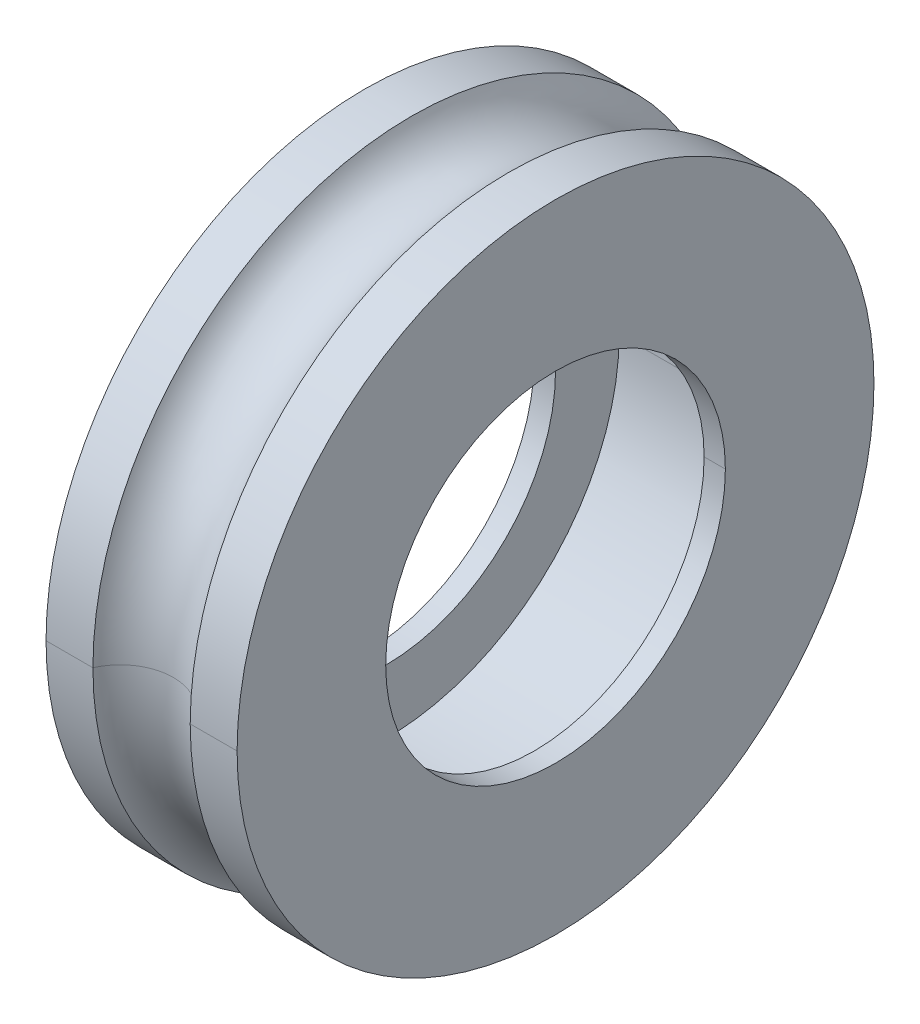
ISO-10303-21;
HEADER;
FILE_DESCRIPTION(('STEP AP214'),'2;1');
FILE_NAME('part.step','',(''),(''),'','','');
FILE_SCHEMA(('AUTOMOTIVE_DESIGN { 1 0 10303 214 1 1 1 1 }'));
ENDSEC;
DATA;
#1=APPLICATION_CONTEXT('core data for automotive mechanical design processes');
#2=APPLICATION_PROTOCOL_DEFINITION('international standard','automotive_design',2000,#1);
#3=PRODUCT_CONTEXT('',#1,'mechanical');
#4=PRODUCT('Part','Part','',(#3));
#5=PRODUCT_RELATED_PRODUCT_CATEGORY('part','',(#4));
#6=PRODUCT_DEFINITION_FORMATION('','',#4);
#7=PRODUCT_DEFINITION_CONTEXT('part definition',#1,'design');
#8=PRODUCT_DEFINITION('design','',#6,#7);
#9=PRODUCT_DEFINITION_SHAPE('','',#8);
#10=(LENGTH_UNIT() NAMED_UNIT(*) SI_UNIT(.MILLI.,.METRE.));
#11=(NAMED_UNIT(*) PLANE_ANGLE_UNIT() SI_UNIT($,.RADIAN.));
#12=(NAMED_UNIT(*) SI_UNIT($,.STERADIAN.) SOLID_ANGLE_UNIT());
#13=UNCERTAINTY_MEASURE_WITH_UNIT(LENGTH_MEASURE(1.E-05),#10,'distance_accuracy_value','');
#14=(GEOMETRIC_REPRESENTATION_CONTEXT(3) GLOBAL_UNCERTAINTY_ASSIGNED_CONTEXT((#13)) GLOBAL_UNIT_ASSIGNED_CONTEXT((#10,
#11,#12)) REPRESENTATION_CONTEXT('',''));
#15=CARTESIAN_POINT('',(0.,0.,0.));
#16=DIRECTION('',(0.,0.,1.));
#17=DIRECTION('',(1.,0.,0.));
#18=AXIS2_PLACEMENT_3D('',#15,#16,#17);
#19=CARTESIAN_POINT('',(-4.5,15.,0.));
#20=DIRECTION('',(-1.,0.,0.));
#21=DIRECTION('',(0.,0.,1.));
#22=AXIS2_PLACEMENT_3D('',#19,#20,#21);
#23=PLANE('',#22);
#24=CARTESIAN_POINT('',(-4.5,0.,0.));
#25=DIRECTION('',(1.,0.,0.));
#26=DIRECTION('',(0.,0.,-1.));
#27=AXIS2_PLACEMENT_3D('',#24,#25,#26);
#28=CIRCLE('',#27,8.);
#29=CARTESIAN_POINT('',(-4.5,0.,-8.));
#30=VERTEX_POINT('',#29);
#31=CARTESIAN_POINT('',(-4.5,0.,8.));
#32=VERTEX_POINT('',#31);
#33=EDGE_CURVE('E11',#30,#32,#28,.T.);
#34=ORIENTED_EDGE('',*,*,#33,.T.);
#35=CARTESIAN_POINT('',(-4.5,0.,0.));
#36=DIRECTION('',(1.,0.,0.));
#37=DIRECTION('',(0.,0.,-1.));
#38=AXIS2_PLACEMENT_3D('',#35,#36,#37);
#39=CIRCLE('',#38,8.);
#40=EDGE_CURVE('E24',#32,#30,#39,.T.);
#41=ORIENTED_EDGE('',*,*,#40,.T.);
#42=EDGE_LOOP('',(#34,#41));
#43=FACE_BOUND('',#42,.T.);
#44=CARTESIAN_POINT('',(-4.5,0.,0.));
#45=DIRECTION('',(1.,0.,0.));
#46=DIRECTION('',(0.,0.,-1.));
#47=AXIS2_PLACEMENT_3D('',#44,#45,#46);
#48=CIRCLE('',#47,15.);
#49=CARTESIAN_POINT('',(-4.5,0.,-15.));
#50=VERTEX_POINT('',#49);
#51=CARTESIAN_POINT('',(-4.5,0.,15.));
#52=VERTEX_POINT('',#51);
#53=EDGE_CURVE('E275',#50,#52,#48,.T.);
#54=ORIENTED_EDGE('',*,*,#53,.F.);
#55=CARTESIAN_POINT('',(-4.5,0.,0.));
#56=DIRECTION('',(1.,0.,0.));
#57=DIRECTION('',(0.,0.,-1.));
#58=AXIS2_PLACEMENT_3D('',#55,#56,#57);
#59=CIRCLE('',#58,15.);
#60=EDGE_CURVE('E270',#52,#50,#59,.T.);
#61=ORIENTED_EDGE('',*,*,#60,.F.);
#62=EDGE_LOOP('',(#54,#61));
#63=FACE_BOUND('',#62,.T.);
#64=ADVANCED_FACE('F16',(#43,#63),#23,.T.);
#65=CARTESIAN_POINT('',(4.5,0.,0.));
#66=DIRECTION('',(-1.,0.,0.));
#67=DIRECTION('',(0.,1.,0.));
#68=AXIS2_PLACEMENT_3D('',#65,#66,#67);
#69=CYLINDRICAL_SURFACE('',#68,15.);
#70=ORIENTED_EDGE('',*,*,#60,.T.);
#71=DIRECTION('',(-1.,0.,0.));
#72=VECTOR('',#71,1.);
#73=CARTESIAN_POINT('',(-2.2912878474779,0.,-15.));
#74=LINE('',#73,#72);
#75=CARTESIAN_POINT('',(-2.2912878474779,0.,-15.));
#76=VERTEX_POINT('',#75);
#77=EDGE_CURVE('E265',#76,#50,#74,.T.);
#78=ORIENTED_EDGE('',*,*,#77,.F.);
#79=CARTESIAN_POINT('',(-2.2912878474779,0.,0.));
#80=DIRECTION('',(1.,0.,0.));
#81=DIRECTION('',(0.,0.,-1.));
#82=AXIS2_PLACEMENT_3D('',#79,#80,#81);
#83=CIRCLE('',#82,15.);
#84=CARTESIAN_POINT('',(-2.29128784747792,0.,15.));
#85=VERTEX_POINT('',#84);
#86=EDGE_CURVE('E261',#85,#76,#83,.T.);
#87=ORIENTED_EDGE('',*,*,#86,.F.);
#88=DIRECTION('',(-1.,0.,0.));
#89=VECTOR('',#88,1.);
#90=CARTESIAN_POINT('',(-2.2912878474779,0.,15.));
#91=LINE('',#90,#89);
#92=EDGE_CURVE('E256',#85,#52,#91,.T.);
#93=ORIENTED_EDGE('',*,*,#92,.T.);
#94=EDGE_LOOP('',(#70,#78,#87,#93));
#95=FACE_BOUND('',#94,.T.);
#96=ADVANCED_FACE('F290',(#95),#69,.T.);
#97=CARTESIAN_POINT('',(4.5,0.,0.));
#98=DIRECTION('',(-1.,0.,0.));
#99=DIRECTION('',(0.,-1.,0.));
#100=AXIS2_PLACEMENT_3D('',#97,#98,#99);
#101=CYLINDRICAL_SURFACE('',#100,15.);
#102=CARTESIAN_POINT('',(-2.2912878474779,0.,0.));
#103=DIRECTION('',(1.,0.,0.));
#104=DIRECTION('',(0.,0.,-1.));
#105=AXIS2_PLACEMENT_3D('',#102,#103,#104);
#106=CIRCLE('',#105,15.);
#107=EDGE_CURVE('E254',#76,#85,#106,.T.);
#108=ORIENTED_EDGE('',*,*,#107,.F.);
#109=ORIENTED_EDGE('',*,*,#77,.T.);
#110=ORIENTED_EDGE('',*,*,#53,.T.);
#111=ORIENTED_EDGE('',*,*,#92,.F.);
#112=EDGE_LOOP('',(#108,#109,#110,#111));
#113=FACE_BOUND('',#112,.T.);
#114=ADVANCED_FACE('F287',(#113),#101,.T.);
#115=CARTESIAN_POINT('',(0.,0.,0.));
#116=DIRECTION('',(1.,0.,0.));
#117=DIRECTION('',(0.,-1.,0.));
#118=AXIS2_PLACEMENT_3D('',#115,#116,#117);
#119=TOROIDAL_SURFACE('',#118,16.,2.5);
#120=ORIENTED_EDGE('',*,*,#107,.T.);
#121=CARTESIAN_POINT('',(2.29128784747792,0.,15.));
#122=CARTESIAN_POINT('',(2.27921225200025,0.,14.9723306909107));
#123=CARTESIAN_POINT('',(2.26663500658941,0.,14.9448803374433));
#124=CARTESIAN_POINT('',(2.240494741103,0.,14.890453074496));
#125=CARTESIAN_POINT('',(2.22693172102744,0.,14.8634761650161));
#126=CARTESIAN_POINT('',(2.19883743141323,0.,14.8100313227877));
#127=CARTESIAN_POINT('',(2.18430616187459,0.,14.7835633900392));
#128=CARTESIAN_POINT('',(2.15429451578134,0.,14.7311711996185));
#129=CARTESIAN_POINT('',(2.13881413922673,0.,14.7052469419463));
#130=CARTESIAN_POINT('',(2.10692457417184,0.,14.6539761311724));
#131=CARTESIAN_POINT('',(2.09051538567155,0.,14.6286295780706));
#132=CARTESIAN_POINT('',(2.05678973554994,0.,14.578547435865));
#133=CARTESIAN_POINT('',(2.03947327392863,0.,14.5538118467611));
#134=CARTESIAN_POINT('',(2.00395580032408,0.,14.5049840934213));
#135=CARTESIAN_POINT('',(1.98575478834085,0.,14.4808919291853));
#136=CARTESIAN_POINT('',(1.94849209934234,0.,14.433382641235));
#137=CARTESIAN_POINT('',(1.92943042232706,0.,14.4099655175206));
#138=CARTESIAN_POINT('',(1.89047141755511,0.,14.3638370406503));
#139=CARTESIAN_POINT('',(1.87057408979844,0.,14.3411256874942));
#140=CARTESIAN_POINT('',(1.82996989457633,0.,14.2964385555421));
#141=CARTESIAN_POINT('',(1.80926302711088,0.,14.274462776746));
#142=CARTESIAN_POINT('',(1.76706692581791,0.,14.231275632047));
#143=CARTESIAN_POINT('',(1.74557769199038,0.,14.2100642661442));
#144=CARTESIAN_POINT('',(1.70184505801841,0.,14.1684337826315));
#145=CARTESIAN_POINT('',(1.67960165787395,0.,14.1480146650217));
#146=CARTESIAN_POINT('',(1.6343898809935,0.,14.1079954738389));
#147=CARTESIAN_POINT('',(1.61142150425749,0.,14.0883954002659));
#148=CARTESIAN_POINT('',(1.56478991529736,0.,14.0500400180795));
#149=CARTESIAN_POINT('',(1.54112670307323,0.,14.031284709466));
#150=CARTESIAN_POINT('',(1.49313649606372,0.,13.994643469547));
#151=CARTESIAN_POINT('',(1.46880950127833,0.,13.9767575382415));
#152=CARTESIAN_POINT('',(1.41952365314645,0.,13.9418785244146));
#153=CARTESIAN_POINT('',(1.39456479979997,0.,13.9248854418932));
#154=CARTESIAN_POINT('',(1.34404798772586,0.,13.8918144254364));
#155=CARTESIAN_POINT('',(1.31849002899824,0.,13.8757364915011));
#156=CARTESIAN_POINT('',(1.26680854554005,0.,13.844516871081));
#157=CARTESIAN_POINT('',(1.24068502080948,0.,13.8293751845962));
#158=CARTESIAN_POINT('',(1.18790668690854,0.,13.8000479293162));
#159=CARTESIAN_POINT('',(1.16125187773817,0.,13.785862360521));
#160=CARTESIAN_POINT('',(1.10744595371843,0.,13.7584659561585));
#161=CARTESIAN_POINT('',(1.08029483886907,0.,13.7452551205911));
#162=CARTESIAN_POINT('',(1.02553193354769,0.,13.7198255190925));
#163=CARTESIAN_POINT('',(0.997920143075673,0.,13.7076067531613));
#164=CARTESIAN_POINT('',(0.942272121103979,0.,13.6841773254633));
#165=CARTESIAN_POINT('',(0.914235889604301,0.,13.6729666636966));
#166=CARTESIAN_POINT('',(0.857775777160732,0.,13.6515681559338));
#167=CARTESIAN_POINT('',(0.829351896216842,0.,13.6413803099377));
#168=CARTESIAN_POINT('',(0.772153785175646,0.,13.6220408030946));
#169=CARTESIAN_POINT('',(0.74337955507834,0.,13.6128891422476));
#170=CARTESIAN_POINT('',(0.685518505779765,0.,13.5956340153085));
#171=CARTESIAN_POINT('',(0.656431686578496,0.,13.5875305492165));
#172=CARTESIAN_POINT('',(0.597983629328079,0.,13.5723824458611));
#173=CARTESIAN_POINT('',(0.56862239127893,0.,13.5653378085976));
#174=CARTESIAN_POINT('',(0.509664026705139,0.,13.5523166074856));
#175=CARTESIAN_POINT('',(0.480066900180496,0.,13.5463400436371));
#176=CARTESIAN_POINT('',(0.42067559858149,0.,13.5354628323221));
#177=CARTESIAN_POINT('',(0.390881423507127,0.,13.5305621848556));
#178=CARTESIAN_POINT('',(0.331135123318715,0.,13.5218432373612));
#179=CARTESIAN_POINT('',(0.301182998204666,0.,13.5180249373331));
#180=CARTESIAN_POINT('',(0.241160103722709,0.,13.511475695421));
#181=CARTESIAN_POINT('',(0.2110893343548,0.,13.508744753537));
#182=CARTESIAN_POINT('',(0.150868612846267,0.,13.5043738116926));
#183=CARTESIAN_POINT('',(0.120718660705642,0.,13.5027338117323));
#184=CARTESIAN_POINT('',(0.0603791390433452,0.,13.500546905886));
#185=CARTESIAN_POINT('',(0.0301895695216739,0.,13.5));
#186=CARTESIAN_POINT('',(-0.0301895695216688,0.,13.5));
#187=CARTESIAN_POINT('',(-0.0603791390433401,0.,13.500546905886));
#188=CARTESIAN_POINT('',(-0.120718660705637,0.,13.5027338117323));
#189=CARTESIAN_POINT('',(-0.150868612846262,0.,13.5043738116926));
#190=CARTESIAN_POINT('',(-0.211089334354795,0.,13.508744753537));
#191=CARTESIAN_POINT('',(-0.241160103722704,0.,13.511475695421));
#192=CARTESIAN_POINT('',(-0.301182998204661,0.,13.5180249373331));
#193=CARTESIAN_POINT('',(-0.33113512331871,0.,13.5218432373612));
#194=CARTESIAN_POINT('',(-0.390881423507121,0.,13.5305621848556));
#195=CARTESIAN_POINT('',(-0.420675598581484,0.,13.5354628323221));
#196=CARTESIAN_POINT('',(-0.48006690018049,0.,13.5463400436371));
#197=CARTESIAN_POINT('',(-0.509664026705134,0.,13.5523166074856));
#198=CARTESIAN_POINT('',(-0.568622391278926,0.,13.5653378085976));
#199=CARTESIAN_POINT('',(-0.597983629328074,0.,13.5723824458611));
#200=CARTESIAN_POINT('',(-0.656431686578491,0.,13.5875305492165));
#201=CARTESIAN_POINT('',(-0.68551850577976,0.,13.5956340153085));
#202=CARTESIAN_POINT('',(-0.743379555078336,0.,13.6128891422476));
#203=CARTESIAN_POINT('',(-0.772153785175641,0.,13.6220408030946));
#204=CARTESIAN_POINT('',(-0.829351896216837,0.,13.6413803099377));
#205=CARTESIAN_POINT('',(-0.857775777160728,0.,13.6515681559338));
#206=CARTESIAN_POINT('',(-0.914235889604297,0.,13.6729666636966));
#207=CARTESIAN_POINT('',(-0.942272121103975,0.,13.6841773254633));
#208=CARTESIAN_POINT('',(-0.997920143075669,0.,13.7076067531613));
#209=CARTESIAN_POINT('',(-1.02553193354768,0.,13.7198255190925));
#210=CARTESIAN_POINT('',(-1.08029483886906,0.,13.7452551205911));
#211=CARTESIAN_POINT('',(-1.10744595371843,0.,13.7584659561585));
#212=CARTESIAN_POINT('',(-1.16125187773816,0.,13.785862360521));
#213=CARTESIAN_POINT('',(-1.18790668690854,0.,13.8000479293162));
#214=CARTESIAN_POINT('',(-1.24068502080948,0.,13.8293751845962));
#215=CARTESIAN_POINT('',(-1.26680854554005,0.,13.844516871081));
#216=CARTESIAN_POINT('',(-1.31849002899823,0.,13.8757364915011));
#217=CARTESIAN_POINT('',(-1.34404798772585,0.,13.8918144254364));
#218=CARTESIAN_POINT('',(-1.39456479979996,0.,13.9248854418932));
#219=CARTESIAN_POINT('',(-1.41952365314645,0.,13.9418785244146));
#220=CARTESIAN_POINT('',(-1.46880950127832,0.,13.9767575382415));
#221=CARTESIAN_POINT('',(-1.49313649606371,0.,13.994643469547));
#222=CARTESIAN_POINT('',(-1.54112670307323,0.,14.031284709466));
#223=CARTESIAN_POINT('',(-1.56478991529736,0.,14.0500400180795));
#224=CARTESIAN_POINT('',(-1.61142150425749,0.,14.0883954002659));
#225=CARTESIAN_POINT('',(-1.63438988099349,0.,14.1079954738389));
#226=CARTESIAN_POINT('',(-1.67960165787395,0.,14.1480146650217));
#227=CARTESIAN_POINT('',(-1.7018450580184,0.,14.1684337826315));
#228=CARTESIAN_POINT('',(-1.74557769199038,0.,14.2100642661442));
#229=CARTESIAN_POINT('',(-1.76706692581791,0.,14.231275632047));
#230=CARTESIAN_POINT('',(-1.80926302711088,0.,14.274462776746));
#231=CARTESIAN_POINT('',(-1.82996989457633,0.,14.2964385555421));
#232=CARTESIAN_POINT('',(-1.87057408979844,0.,14.3411256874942));
#233=CARTESIAN_POINT('',(-1.8904714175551,0.,14.3638370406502));
#234=CARTESIAN_POINT('',(-1.92943042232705,0.,14.4099655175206));
#235=CARTESIAN_POINT('',(-1.94849209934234,0.,14.433382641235));
#236=CARTESIAN_POINT('',(-1.98575478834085,0.,14.4808919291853));
#237=CARTESIAN_POINT('',(-2.00395580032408,0.,14.5049840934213));
#238=CARTESIAN_POINT('',(-2.03947327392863,0.,14.5538118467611));
#239=CARTESIAN_POINT('',(-2.05678973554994,0.,14.5785474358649));
#240=CARTESIAN_POINT('',(-2.09051538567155,0.,14.6286295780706));
#241=CARTESIAN_POINT('',(-2.10692457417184,0.,14.6539761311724));
#242=CARTESIAN_POINT('',(-2.13881413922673,0.,14.7052469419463));
#243=CARTESIAN_POINT('',(-2.15429451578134,0.,14.7311711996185));
#244=CARTESIAN_POINT('',(-2.18430616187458,0.,14.7835633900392));
#245=CARTESIAN_POINT('',(-2.19883743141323,0.,14.8100313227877));
#246=CARTESIAN_POINT('',(-2.22693172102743,0.,14.8634761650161));
#247=CARTESIAN_POINT('',(-2.240494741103,0.,14.890453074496));
#248=CARTESIAN_POINT('',(-2.2666350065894,0.,14.9448803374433));
#249=CARTESIAN_POINT('',(-2.27921225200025,0.,14.9723306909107));
#250=CARTESIAN_POINT('',(-2.29128784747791,0.,15.));
#251=B_SPLINE_CURVE_WITH_KNOTS('',3,(#121,#122,#123,#124,#125,#126,#127,#128,#129,#130,#131,
#132,#133,#134,#135,#136,#137,#138,#139,#140,#141,#142,#143,#144,#145,#146,#147,#148,#149,#150,
#151,#152,#153,#154,#155,#156,#157,#158,#159,#160,#161,#162,#163,#164,#165,#166,#167,#168,#169,
#170,#171,#172,#173,#174,#175,#176,#177,#178,#179,#180,#181,#182,#183,#184,#185,#186,#187,#188,
#189,#190,#191,#192,#193,#194,#195,#196,#197,#198,#199,#200,#201,#202,#203,#204,#205,#206,#207,
#208,#209,#210,#211,#212,#213,#214,#215,#216,#217,#218,#219,#220,#221,#222,#223,#224,#225,#226,
#227,#228,#229,#230,#231,#232,#233,#234,#235,#236,#237,#238,#239,#240,#241,#242,#243,#244,#245,
#246,#247,#248,#249,#250),.UNSPECIFIED.,.F.,.F.,(4,2,2,2,2,2,2,2,2,2,2,2,2,2,2,2,2,2,2,2,2,2,2,
2,2,2,2,2,2,2,2,2,2,2,2,2,2,2,2,2,2,2,2,2,2,2,2,2,2,2,2,2,2,2,2,2,2,2,2,2,2,2,2,2,4),(0.,
0.0905637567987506,0.1811275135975,0.271691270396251,0.362255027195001,0.45281878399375,
0.543382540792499,0.633946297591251,0.72451005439,0.81507381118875,0.905637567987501,
0.99620132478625,1.086765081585,1.17732883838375,1.2678925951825,1.35845635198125,1.44902010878,
1.53958386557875,1.6301476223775,1.72071137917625,1.811275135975,1.90183889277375,
1.9924026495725,2.08296640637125,2.17353016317,2.26409391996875,2.3546576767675,
2.44522143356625,2.535785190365,2.62634894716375,2.7169127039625,2.80747646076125,2.89804021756,
2.98860397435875,3.0791677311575,3.16973148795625,3.260295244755,3.35085900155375,
3.4414227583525,3.53198651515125,3.62255027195,3.71311402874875,3.8036777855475,
3.89424154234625,3.984805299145,4.07536905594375,4.1659328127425,4.25649656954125,4.34706032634,
4.43762408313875,4.5281878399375,4.61875159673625,4.709315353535,4.79987911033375,
4.8904428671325,4.98100662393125,5.07157038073,5.16213413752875,5.2526978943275,
5.34326165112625,5.433825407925,5.52438916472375,5.6149529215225,5.70551667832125,
5.79608043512),.UNSPECIFIED.);
#252=CARTESIAN_POINT('',(2.2912878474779,0.,15.));
#253=VERTEX_POINT('',#252);
#254=EDGE_CURVE('E222',#253,#85,#251,.T.);
#255=ORIENTED_EDGE('',*,*,#254,.F.);
#256=CARTESIAN_POINT('',(2.2912878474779,0.,0.));
#257=DIRECTION('',(1.,0.,0.));
#258=DIRECTION('',(0.,0.,-1.));
#259=AXIS2_PLACEMENT_3D('',#256,#257,#258);
#260=CIRCLE('',#259,15.);
#261=CARTESIAN_POINT('',(2.2912878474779,0.,-15.));
#262=VERTEX_POINT('',#261);
#263=EDGE_CURVE('E240',#262,#253,#260,.T.);
#264=ORIENTED_EDGE('',*,*,#263,.F.);
#265=CARTESIAN_POINT('',(2.29128784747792,0.,-15.));
#266=CARTESIAN_POINT('',(2.27921225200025,0.,-14.9723306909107));
#267=CARTESIAN_POINT('',(2.26663500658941,0.,-14.9448803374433));
#268=CARTESIAN_POINT('',(2.240494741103,0.,-14.890453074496));
#269=CARTESIAN_POINT('',(2.22693172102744,0.,-14.8634761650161));
#270=CARTESIAN_POINT('',(2.19883743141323,0.,-14.8100313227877));
#271=CARTESIAN_POINT('',(2.18430616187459,0.,-14.7835633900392));
#272=CARTESIAN_POINT('',(2.15429451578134,0.,-14.7311711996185));
#273=CARTESIAN_POINT('',(2.13881413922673,0.,-14.7052469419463));
#274=CARTESIAN_POINT('',(2.10692457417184,0.,-14.6539761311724));
#275=CARTESIAN_POINT('',(2.09051538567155,0.,-14.6286295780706));
#276=CARTESIAN_POINT('',(2.05678973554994,0.,-14.578547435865));
#277=CARTESIAN_POINT('',(2.03947327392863,0.,-14.5538118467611));
#278=CARTESIAN_POINT('',(2.00395580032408,0.,-14.5049840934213));
#279=CARTESIAN_POINT('',(1.98575478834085,0.,-14.4808919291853));
#280=CARTESIAN_POINT('',(1.94849209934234,0.,-14.433382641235));
#281=CARTESIAN_POINT('',(1.92943042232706,0.,-14.4099655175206));
#282=CARTESIAN_POINT('',(1.89047141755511,0.,-14.3638370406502));
#283=CARTESIAN_POINT('',(1.87057408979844,0.,-14.3411256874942));
#284=CARTESIAN_POINT('',(1.82996989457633,0.,-14.2964385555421));
#285=CARTESIAN_POINT('',(1.80926302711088,0.,-14.274462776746));
#286=CARTESIAN_POINT('',(1.76706692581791,0.,-14.231275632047));
#287=CARTESIAN_POINT('',(1.74557769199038,0.,-14.2100642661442));
#288=CARTESIAN_POINT('',(1.7018450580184,0.,-14.1684337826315));
#289=CARTESIAN_POINT('',(1.67960165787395,0.,-14.1480146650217));
#290=CARTESIAN_POINT('',(1.63438988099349,0.,-14.1079954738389));
#291=CARTESIAN_POINT('',(1.61142150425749,0.,-14.0883954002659));
#292=CARTESIAN_POINT('',(1.56478991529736,0.,-14.0500400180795));
#293=CARTESIAN_POINT('',(1.54112670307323,0.,-14.031284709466));
#294=CARTESIAN_POINT('',(1.49313649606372,0.,-13.994643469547));
#295=CARTESIAN_POINT('',(1.46880950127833,0.,-13.9767575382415));
#296=CARTESIAN_POINT('',(1.41952365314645,0.,-13.9418785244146));
#297=CARTESIAN_POINT('',(1.39456479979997,0.,-13.9248854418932));
#298=CARTESIAN_POINT('',(1.34404798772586,0.,-13.8918144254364));
#299=CARTESIAN_POINT('',(1.31849002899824,0.,-13.8757364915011));
#300=CARTESIAN_POINT('',(1.26680854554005,0.,-13.844516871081));
#301=CARTESIAN_POINT('',(1.24068502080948,0.,-13.8293751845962));
#302=CARTESIAN_POINT('',(1.18790668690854,0.,-13.8000479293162));
#303=CARTESIAN_POINT('',(1.16125187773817,0.,-13.785862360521));
#304=CARTESIAN_POINT('',(1.10744595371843,0.,-13.7584659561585));
#305=CARTESIAN_POINT('',(1.08029483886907,0.,-13.7452551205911));
#306=CARTESIAN_POINT('',(1.02553193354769,0.,-13.7198255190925));
#307=CARTESIAN_POINT('',(0.997920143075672,0.,-13.7076067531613));
#308=CARTESIAN_POINT('',(0.942272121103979,0.,-13.6841773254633));
#309=CARTESIAN_POINT('',(0.9142358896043,0.,-13.6729666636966));
#310=CARTESIAN_POINT('',(0.857775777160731,0.,-13.6515681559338));
#311=CARTESIAN_POINT('',(0.829351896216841,0.,-13.6413803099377));
#312=CARTESIAN_POINT('',(0.772153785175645,0.,-13.6220408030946));
#313=CARTESIAN_POINT('',(0.743379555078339,0.,-13.6128891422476));
#314=CARTESIAN_POINT('',(0.685518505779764,0.,-13.5956340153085));
#315=CARTESIAN_POINT('',(0.656431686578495,0.,-13.5875305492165));
#316=CARTESIAN_POINT('',(0.597983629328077,0.,-13.5723824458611));
#317=CARTESIAN_POINT('',(0.568622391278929,0.,-13.5653378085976));
#318=CARTESIAN_POINT('',(0.509664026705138,0.,-13.5523166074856));
#319=CARTESIAN_POINT('',(0.480066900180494,0.,-13.5463400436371));
#320=CARTESIAN_POINT('',(0.420675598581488,0.,-13.5354628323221));
#321=CARTESIAN_POINT('',(0.390881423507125,0.,-13.5305621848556));
#322=CARTESIAN_POINT('',(0.331135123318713,0.,-13.5218432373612));
#323=CARTESIAN_POINT('',(0.301182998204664,0.,-13.5180249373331));
#324=CARTESIAN_POINT('',(0.241160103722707,0.,-13.511475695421));
#325=CARTESIAN_POINT('',(0.211089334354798,0.,-13.508744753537));
#326=CARTESIAN_POINT('',(0.150868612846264,0.,-13.5043738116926));
#327=CARTESIAN_POINT('',(0.120718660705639,0.,-13.5027338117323));
#328=CARTESIAN_POINT('',(0.0603791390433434,0.,-13.500546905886));
#329=CARTESIAN_POINT('',(0.0301895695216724,0.,-13.5));
#330=CARTESIAN_POINT('',(-0.0301895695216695,0.,-13.5));
#331=CARTESIAN_POINT('',(-0.0603791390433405,0.,-13.500546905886));
#332=CARTESIAN_POINT('',(-0.120718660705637,0.,-13.5027338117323));
#333=CARTESIAN_POINT('',(-0.150868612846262,0.,-13.5043738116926));
#334=CARTESIAN_POINT('',(-0.211089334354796,0.,-13.508744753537));
#335=CARTESIAN_POINT('',(-0.241160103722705,0.,-13.511475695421));
#336=CARTESIAN_POINT('',(-0.301182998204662,0.,-13.5180249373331));
#337=CARTESIAN_POINT('',(-0.33113512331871,0.,-13.5218432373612));
#338=CARTESIAN_POINT('',(-0.390881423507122,0.,-13.5305621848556));
#339=CARTESIAN_POINT('',(-0.420675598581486,0.,-13.5354628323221));
#340=CARTESIAN_POINT('',(-0.480066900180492,0.,-13.5463400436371));
#341=CARTESIAN_POINT('',(-0.509664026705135,0.,-13.5523166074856));
#342=CARTESIAN_POINT('',(-0.568622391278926,0.,-13.5653378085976));
#343=CARTESIAN_POINT('',(-0.597983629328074,0.,-13.5723824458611));
#344=CARTESIAN_POINT('',(-0.656431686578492,0.,-13.5875305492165));
#345=CARTESIAN_POINT('',(-0.685518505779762,0.,-13.5956340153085));
#346=CARTESIAN_POINT('',(-0.743379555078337,0.,-13.6128891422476));
#347=CARTESIAN_POINT('',(-0.772153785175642,0.,-13.6220408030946));
#348=CARTESIAN_POINT('',(-0.829351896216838,0.,-13.6413803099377));
#349=CARTESIAN_POINT('',(-0.857775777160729,0.,-13.6515681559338));
#350=CARTESIAN_POINT('',(-0.914235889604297,0.,-13.6729666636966));
#351=CARTESIAN_POINT('',(-0.942272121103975,0.,-13.6841773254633));
#352=CARTESIAN_POINT('',(-0.997920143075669,0.,-13.7076067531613));
#353=CARTESIAN_POINT('',(-1.02553193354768,0.,-13.7198255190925));
#354=CARTESIAN_POINT('',(-1.08029483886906,0.,-13.7452551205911));
#355=CARTESIAN_POINT('',(-1.10744595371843,0.,-13.7584659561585));
#356=CARTESIAN_POINT('',(-1.16125187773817,0.,-13.785862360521));
#357=CARTESIAN_POINT('',(-1.18790668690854,0.,-13.8000479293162));
#358=CARTESIAN_POINT('',(-1.24068502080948,0.,-13.8293751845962));
#359=CARTESIAN_POINT('',(-1.26680854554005,0.,-13.844516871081));
#360=CARTESIAN_POINT('',(-1.31849002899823,0.,-13.8757364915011));
#361=CARTESIAN_POINT('',(-1.34404798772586,0.,-13.8918144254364));
#362=CARTESIAN_POINT('',(-1.39456479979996,0.,-13.9248854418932));
#363=CARTESIAN_POINT('',(-1.41952365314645,0.,-13.9418785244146));
#364=CARTESIAN_POINT('',(-1.46880950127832,0.,-13.9767575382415));
#365=CARTESIAN_POINT('',(-1.49313649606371,0.,-13.994643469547));
#366=CARTESIAN_POINT('',(-1.54112670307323,0.,-14.031284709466));
#367=CARTESIAN_POINT('',(-1.56478991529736,0.,-14.0500400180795));
#368=CARTESIAN_POINT('',(-1.61142150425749,0.,-14.0883954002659));
#369=CARTESIAN_POINT('',(-1.63438988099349,0.,-14.1079954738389));
#370=CARTESIAN_POINT('',(-1.67960165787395,0.,-14.1480146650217));
#371=CARTESIAN_POINT('',(-1.7018450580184,0.,-14.1684337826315));
#372=CARTESIAN_POINT('',(-1.74557769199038,0.,-14.2100642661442));
#373=CARTESIAN_POINT('',(-1.76706692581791,0.,-14.231275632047));
#374=CARTESIAN_POINT('',(-1.80926302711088,0.,-14.274462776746));
#375=CARTESIAN_POINT('',(-1.82996989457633,0.,-14.2964385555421));
#376=CARTESIAN_POINT('',(-1.87057408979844,0.,-14.3411256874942));
#377=CARTESIAN_POINT('',(-1.89047141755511,0.,-14.3638370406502));
#378=CARTESIAN_POINT('',(-1.92943042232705,0.,-14.4099655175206));
#379=CARTESIAN_POINT('',(-1.94849209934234,0.,-14.433382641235));
#380=CARTESIAN_POINT('',(-1.98575478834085,0.,-14.4808919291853));
#381=CARTESIAN_POINT('',(-2.00395580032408,0.,-14.5049840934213));
#382=CARTESIAN_POINT('',(-2.03947327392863,0.,-14.5538118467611));
#383=CARTESIAN_POINT('',(-2.05678973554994,0.,-14.578547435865));
#384=CARTESIAN_POINT('',(-2.09051538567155,0.,-14.6286295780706));
#385=CARTESIAN_POINT('',(-2.10692457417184,0.,-14.6539761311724));
#386=CARTESIAN_POINT('',(-2.13881413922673,0.,-14.7052469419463));
#387=CARTESIAN_POINT('',(-2.15429451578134,0.,-14.7311711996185));
#388=CARTESIAN_POINT('',(-2.18430616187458,0.,-14.7835633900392));
#389=CARTESIAN_POINT('',(-2.19883743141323,0.,-14.8100313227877));
#390=CARTESIAN_POINT('',(-2.22693172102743,0.,-14.8634761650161));
#391=CARTESIAN_POINT('',(-2.240494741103,0.,-14.890453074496));
#392=CARTESIAN_POINT('',(-2.2666350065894,0.,-14.9448803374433));
#393=CARTESIAN_POINT('',(-2.27921225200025,0.,-14.9723306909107));
#394=CARTESIAN_POINT('',(-2.29128784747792,0.,-15.));
#395=B_SPLINE_CURVE_WITH_KNOTS('',3,(#265,#266,#267,#268,#269,#270,#271,#272,#273,#274,#275,
#276,#277,#278,#279,#280,#281,#282,#283,#284,#285,#286,#287,#288,#289,#290,#291,#292,#293,#294,
#295,#296,#297,#298,#299,#300,#301,#302,#303,#304,#305,#306,#307,#308,#309,#310,#311,#312,#313,
#314,#315,#316,#317,#318,#319,#320,#321,#322,#323,#324,#325,#326,#327,#328,#329,#330,#331,#332,
#333,#334,#335,#336,#337,#338,#339,#340,#341,#342,#343,#344,#345,#346,#347,#348,#349,#350,#351,
#352,#353,#354,#355,#356,#357,#358,#359,#360,#361,#362,#363,#364,#365,#366,#367,#368,#369,#370,
#371,#372,#373,#374,#375,#376,#377,#378,#379,#380,#381,#382,#383,#384,#385,#386,#387,#388,#389,
#390,#391,#392,#393,#394),.UNSPECIFIED.,.F.,.F.,(4,2,2,2,2,2,2,2,2,2,2,2,2,2,2,2,2,2,2,2,2,2,2,
2,2,2,2,2,2,2,2,2,2,2,2,2,2,2,2,2,2,2,2,2,2,2,2,2,2,2,2,2,2,2,2,2,2,2,2,2,2,2,2,2,4),(0.,
0.0905637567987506,0.1811275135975,0.271691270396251,0.362255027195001,0.45281878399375,
0.543382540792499,0.633946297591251,0.724510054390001,0.81507381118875,0.905637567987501,
0.996201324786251,1.086765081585,1.17732883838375,1.2678925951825,1.35845635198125,
1.44902010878,1.53958386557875,1.6301476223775,1.72071137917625,1.811275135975,1.90183889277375,
1.9924026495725,2.08296640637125,2.17353016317,2.26409391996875,2.3546576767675,
2.44522143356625,2.535785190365,2.62634894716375,2.7169127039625,2.80747646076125,2.89804021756,
2.98860397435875,3.0791677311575,3.16973148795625,3.260295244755,3.35085900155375,
3.4414227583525,3.53198651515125,3.62255027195,3.71311402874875,3.8036777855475,
3.89424154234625,3.984805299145,4.07536905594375,4.1659328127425,4.25649656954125,4.34706032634,
4.43762408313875,4.5281878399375,4.61875159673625,4.709315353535,4.79987911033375,
4.8904428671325,4.98100662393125,5.07157038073,5.16213413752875,5.2526978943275,
5.34326165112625,5.43382540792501,5.52438916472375,5.6149529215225,5.70551667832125,
5.79608043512),.UNSPECIFIED.);
#396=EDGE_CURVE('E225',#262,#76,#395,.T.);
#397=ORIENTED_EDGE('',*,*,#396,.T.);
#398=EDGE_LOOP('',(#120,#255,#264,#397));
#399=FACE_BOUND('',#398,.T.);
#400=ADVANCED_FACE('F204',(#399),#119,.F.);
#401=CARTESIAN_POINT('',(0.,0.,0.));
#402=DIRECTION('',(1.,0.,0.));
#403=DIRECTION('',(0.,1.,0.));
#404=AXIS2_PLACEMENT_3D('',#401,#402,#403);
#405=TOROIDAL_SURFACE('',#404,16.,2.5);
#406=CARTESIAN_POINT('',(2.2912878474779,0.,0.));
#407=DIRECTION('',(1.,0.,0.));
#408=DIRECTION('',(0.,0.,-1.));
#409=AXIS2_PLACEMENT_3D('',#406,#407,#408);
#410=CIRCLE('',#409,15.);
#411=EDGE_CURVE('E184',#253,#262,#410,.T.);
#412=ORIENTED_EDGE('',*,*,#411,.F.);
#413=ORIENTED_EDGE('',*,*,#254,.T.);
#414=ORIENTED_EDGE('',*,*,#86,.T.);
#415=ORIENTED_EDGE('',*,*,#396,.F.);
#416=EDGE_LOOP('',(#412,#413,#414,#415));
#417=FACE_BOUND('',#416,.T.);
#418=ADVANCED_FACE('F193',(#417),#405,.F.);
#419=CARTESIAN_POINT('',(4.5,0.,0.));
#420=DIRECTION('',(-1.,0.,0.));
#421=DIRECTION('',(0.,1.,0.));
#422=AXIS2_PLACEMENT_3D('',#419,#420,#421);
#423=CYLINDRICAL_SURFACE('',#422,15.);
#424=ORIENTED_EDGE('',*,*,#411,.T.);
#425=DIRECTION('',(-1.,0.,0.));
#426=VECTOR('',#425,1.);
#427=CARTESIAN_POINT('',(4.5,0.,-15.));
#428=LINE('',#427,#426);
#429=CARTESIAN_POINT('',(4.5,0.,-15.));
#430=VERTEX_POINT('',#429);
#431=EDGE_CURVE('E179',#430,#262,#428,.T.);
#432=ORIENTED_EDGE('',*,*,#431,.F.);
#433=CARTESIAN_POINT('',(4.5,0.,0.));
#434=DIRECTION('',(1.,0.,0.));
#435=DIRECTION('',(0.,0.,-1.));
#436=AXIS2_PLACEMENT_3D('',#433,#434,#435);
#437=CIRCLE('',#436,15.);
#438=CARTESIAN_POINT('',(4.5,0.,15.));
#439=VERTEX_POINT('',#438);
#440=EDGE_CURVE('E174',#439,#430,#437,.T.);
#441=ORIENTED_EDGE('',*,*,#440,.F.);
#442=DIRECTION('',(-1.,0.,0.));
#443=VECTOR('',#442,1.);
#444=CARTESIAN_POINT('',(4.5,0.,15.));
#445=LINE('',#444,#443);
#446=EDGE_CURVE('E169',#439,#253,#445,.T.);
#447=ORIENTED_EDGE('',*,*,#446,.T.);
#448=EDGE_LOOP('',(#424,#432,#441,#447));
#449=FACE_BOUND('',#448,.T.);
#450=ADVANCED_FACE('F203',(#449),#423,.T.);
#451=CARTESIAN_POINT('',(4.5,0.,0.));
#452=DIRECTION('',(-1.,0.,0.));
#453=DIRECTION('',(0.,-1.,0.));
#454=AXIS2_PLACEMENT_3D('',#451,#452,#453);
#455=CYLINDRICAL_SURFACE('',#454,15.);
#456=CARTESIAN_POINT('',(4.5,0.,0.));
#457=DIRECTION('',(1.,0.,0.));
#458=DIRECTION('',(0.,0.,-1.));
#459=AXIS2_PLACEMENT_3D('',#456,#457,#458);
#460=CIRCLE('',#459,15.);
#461=EDGE_CURVE('E164',#430,#439,#460,.T.);
#462=ORIENTED_EDGE('',*,*,#461,.F.);
#463=ORIENTED_EDGE('',*,*,#431,.T.);
#464=ORIENTED_EDGE('',*,*,#263,.T.);
#465=ORIENTED_EDGE('',*,*,#446,.F.);
#466=EDGE_LOOP('',(#462,#463,#464,#465));
#467=FACE_BOUND('',#466,.T.);
#468=ADVANCED_FACE('F295',(#467),#455,.T.);
#469=CARTESIAN_POINT('',(4.5,8.,0.));
#470=DIRECTION('',(1.,0.,0.));
#471=DIRECTION('',(0.,0.,-1.));
#472=AXIS2_PLACEMENT_3D('',#469,#470,#471);
#473=PLANE('',#472);
#474=ORIENTED_EDGE('',*,*,#461,.T.);
#475=ORIENTED_EDGE('',*,*,#440,.T.);
#476=EDGE_LOOP('',(#474,#475));
#477=FACE_BOUND('',#476,.T.);
#478=CARTESIAN_POINT('',(4.5,0.,0.));
#479=DIRECTION('',(1.,0.,0.));
#480=DIRECTION('',(0.,0.,-1.));
#481=AXIS2_PLACEMENT_3D('',#478,#479,#480);
#482=CIRCLE('',#481,8.);
#483=CARTESIAN_POINT('',(4.5,0.,-8.));
#484=VERTEX_POINT('',#483);
#485=CARTESIAN_POINT('',(4.5,0.,8.));
#486=VERTEX_POINT('',#485);
#487=EDGE_CURVE('E159',#484,#486,#482,.T.);
#488=ORIENTED_EDGE('',*,*,#487,.F.);
#489=CARTESIAN_POINT('',(4.5,0.,0.));
#490=DIRECTION('',(1.,0.,0.));
#491=DIRECTION('',(0.,0.,-1.));
#492=AXIS2_PLACEMENT_3D('',#489,#490,#491);
#493=CIRCLE('',#492,8.);
#494=EDGE_CURVE('E154',#486,#484,#493,.T.);
#495=ORIENTED_EDGE('',*,*,#494,.F.);
#496=EDGE_LOOP('',(#488,#495));
#497=FACE_BOUND('',#496,.T.);
#498=ADVANCED_FACE('F297',(#477,#497),#473,.T.);
#499=CARTESIAN_POINT('',(4.5,0.,0.));
#500=DIRECTION('',(-1.,0.,0.));
#501=DIRECTION('',(0.,1.,0.));
#502=AXIS2_PLACEMENT_3D('',#499,#500,#501);
#503=CYLINDRICAL_SURFACE('',#502,8.);
#504=CARTESIAN_POINT('',(3.5,0.,0.));
#505=DIRECTION('',(1.,0.,0.));
#506=DIRECTION('',(0.,0.,-1.));
#507=AXIS2_PLACEMENT_3D('',#504,#505,#506);
#508=CIRCLE('',#507,8.);
#509=CARTESIAN_POINT('',(3.5,0.,8.));
#510=VERTEX_POINT('',#509);
#511=CARTESIAN_POINT('',(3.5,0.,-8.));
#512=VERTEX_POINT('',#511);
#513=EDGE_CURVE('E149',#510,#512,#508,.T.);
#514=ORIENTED_EDGE('',*,*,#513,.F.);
#515=DIRECTION('',(-1.,0.,0.));
#516=VECTOR('',#515,1.);
#517=CARTESIAN_POINT('',(4.5,0.,8.));
#518=LINE('',#517,#516);
#519=EDGE_CURVE('E144',#486,#510,#518,.T.);
#520=ORIENTED_EDGE('',*,*,#519,.F.);
#521=ORIENTED_EDGE('',*,*,#494,.T.);
#522=DIRECTION('',(-1.,0.,0.));
#523=VECTOR('',#522,1.);
#524=CARTESIAN_POINT('',(4.5,0.,-8.));
#525=LINE('',#524,#523);
#526=EDGE_CURVE('E140',#484,#512,#525,.T.);
#527=ORIENTED_EDGE('',*,*,#526,.T.);
#528=EDGE_LOOP('',(#514,#520,#521,#527));
#529=FACE_BOUND('',#528,.T.);
#530=ADVANCED_FACE('F300',(#529),#503,.F.);
#531=CARTESIAN_POINT('',(4.5,0.,0.));
#532=DIRECTION('',(-1.,0.,0.));
#533=DIRECTION('',(0.,-1.,0.));
#534=AXIS2_PLACEMENT_3D('',#531,#532,#533);
#535=CYLINDRICAL_SURFACE('',#534,8.);
#536=ORIENTED_EDGE('',*,*,#487,.T.);
#537=ORIENTED_EDGE('',*,*,#519,.T.);
#538=CARTESIAN_POINT('',(3.5,0.,0.));
#539=DIRECTION('',(1.,0.,0.));
#540=DIRECTION('',(0.,0.,-1.));
#541=AXIS2_PLACEMENT_3D('',#538,#539,#540);
#542=CIRCLE('',#541,8.);
#543=EDGE_CURVE('E135',#512,#510,#542,.T.);
#544=ORIENTED_EDGE('',*,*,#543,.F.);
#545=ORIENTED_EDGE('',*,*,#526,.F.);
#546=EDGE_LOOP('',(#536,#537,#544,#545));
#547=FACE_BOUND('',#546,.T.);
#548=ADVANCED_FACE('F307',(#547),#535,.F.);
#549=CARTESIAN_POINT('',(3.5,11.,0.));
#550=DIRECTION('',(-1.,0.,0.));
#551=DIRECTION('',(0.,0.,1.));
#552=AXIS2_PLACEMENT_3D('',#549,#550,#551);
#553=PLANE('',#552);
#554=ORIENTED_EDGE('',*,*,#543,.T.);
#555=ORIENTED_EDGE('',*,*,#513,.T.);
#556=EDGE_LOOP('',(#554,#555));
#557=FACE_BOUND('',#556,.T.);
#558=CARTESIAN_POINT('',(3.5,0.,0.));
#559=DIRECTION('',(1.,0.,0.));
#560=DIRECTION('',(0.,0.,-1.));
#561=AXIS2_PLACEMENT_3D('',#558,#559,#560);
#562=CIRCLE('',#561,11.);
#563=CARTESIAN_POINT('',(3.5,0.,-11.));
#564=VERTEX_POINT('',#563);
#565=CARTESIAN_POINT('',(3.5,0.,11.));
#566=VERTEX_POINT('',#565);
#567=EDGE_CURVE('E130',#564,#566,#562,.T.);
#568=ORIENTED_EDGE('',*,*,#567,.F.);
#569=CARTESIAN_POINT('',(3.5,0.,0.));
#570=DIRECTION('',(1.,0.,0.));
#571=DIRECTION('',(0.,0.,-1.));
#572=AXIS2_PLACEMENT_3D('',#569,#570,#571);
#573=CIRCLE('',#572,11.);
#574=EDGE_CURVE('E125',#566,#564,#573,.T.);
#575=ORIENTED_EDGE('',*,*,#574,.F.);
#576=EDGE_LOOP('',(#568,#575));
#577=FACE_BOUND('',#576,.T.);
#578=ADVANCED_FACE('F309',(#557,#577),#553,.T.);
#579=CARTESIAN_POINT('',(4.5,0.,0.));
#580=DIRECTION('',(-1.,0.,0.));
#581=DIRECTION('',(0.,1.,0.));
#582=AXIS2_PLACEMENT_3D('',#579,#580,#581);
#583=CYLINDRICAL_SURFACE('',#582,11.);
#584=CARTESIAN_POINT('',(-3.5,0.,0.));
#585=DIRECTION('',(1.,0.,0.));
#586=DIRECTION('',(0.,0.,-1.));
#587=AXIS2_PLACEMENT_3D('',#584,#585,#586);
#588=CIRCLE('',#587,11.);
#589=CARTESIAN_POINT('',(-3.5,0.,11.));
#590=VERTEX_POINT('',#589);
#591=CARTESIAN_POINT('',(-3.5,0.,-11.));
#592=VERTEX_POINT('',#591);
#593=EDGE_CURVE('E120',#590,#592,#588,.T.);
#594=ORIENTED_EDGE('',*,*,#593,.F.);
#595=DIRECTION('',(-1.,0.,0.));
#596=VECTOR('',#595,1.);
#597=CARTESIAN_POINT('',(3.5,0.,11.));
#598=LINE('',#597,#596);
#599=EDGE_CURVE('E115',#566,#590,#598,.T.);
#600=ORIENTED_EDGE('',*,*,#599,.F.);
#601=ORIENTED_EDGE('',*,*,#574,.T.);
#602=DIRECTION('',(-1.,0.,0.));
#603=VECTOR('',#602,1.);
#604=CARTESIAN_POINT('',(3.5,0.,-11.));
#605=LINE('',#604,#603);
#606=EDGE_CURVE('E105',#564,#592,#605,.T.);
#607=ORIENTED_EDGE('',*,*,#606,.T.);
#608=EDGE_LOOP('',(#594,#600,#601,#607));
#609=FACE_BOUND('',#608,.T.);
#610=ADVANCED_FACE('F312',(#609),#583,.F.);
#611=CARTESIAN_POINT('',(4.5,0.,0.));
#612=DIRECTION('',(-1.,0.,0.));
#613=DIRECTION('',(0.,-1.,0.));
#614=AXIS2_PLACEMENT_3D('',#611,#612,#613);
#615=CYLINDRICAL_SURFACE('',#614,11.);
#616=ORIENTED_EDGE('',*,*,#567,.T.);
#617=ORIENTED_EDGE('',*,*,#599,.T.);
#618=CARTESIAN_POINT('',(-3.5,0.,0.));
#619=DIRECTION('',(1.,0.,0.));
#620=DIRECTION('',(0.,0.,-1.));
#621=AXIS2_PLACEMENT_3D('',#618,#619,#620);
#622=CIRCLE('',#621,11.);
#623=EDGE_CURVE('E102',#592,#590,#622,.T.);
#624=ORIENTED_EDGE('',*,*,#623,.F.);
#625=ORIENTED_EDGE('',*,*,#606,.F.);
#626=EDGE_LOOP('',(#616,#617,#624,#625));
#627=FACE_BOUND('',#626,.T.);
#628=ADVANCED_FACE('F319',(#627),#615,.F.);
#629=CARTESIAN_POINT('',(-3.5,8.,0.));
#630=DIRECTION('',(1.,0.,0.));
#631=DIRECTION('',(0.,0.,-1.));
#632=AXIS2_PLACEMENT_3D('',#629,#630,#631);
#633=PLANE('',#632);
#634=ORIENTED_EDGE('',*,*,#623,.T.);
#635=ORIENTED_EDGE('',*,*,#593,.T.);
#636=EDGE_LOOP('',(#634,#635));
#637=FACE_BOUND('',#636,.T.);
#638=CARTESIAN_POINT('',(-3.5,0.,0.));
#639=DIRECTION('',(1.,0.,0.));
#640=DIRECTION('',(0.,0.,-1.));
#641=AXIS2_PLACEMENT_3D('',#638,#639,#640);
#642=CIRCLE('',#641,8.);
#643=CARTESIAN_POINT('',(-3.5,0.,-8.));
#644=VERTEX_POINT('',#643);
#645=CARTESIAN_POINT('',(-3.5,0.,8.));
#646=VERTEX_POINT('',#645);
#647=EDGE_CURVE('E91',#644,#646,#642,.T.);
#648=ORIENTED_EDGE('',*,*,#647,.F.);
#649=CARTESIAN_POINT('',(-3.5,0.,0.));
#650=DIRECTION('',(1.,0.,0.));
#651=DIRECTION('',(0.,0.,-1.));
#652=AXIS2_PLACEMENT_3D('',#649,#650,#651);
#653=CIRCLE('',#652,8.);
#654=EDGE_CURVE('E87',#646,#644,#653,.T.);
#655=ORIENTED_EDGE('',*,*,#654,.F.);
#656=EDGE_LOOP('',(#648,#655));
#657=FACE_BOUND('',#656,.T.);
#658=ADVANCED_FACE('F89',(#637,#657),#633,.T.);
#659=CARTESIAN_POINT('',(4.5,0.,0.));
#660=DIRECTION('',(-1.,0.,0.));
#661=DIRECTION('',(0.,1.,0.));
#662=AXIS2_PLACEMENT_3D('',#659,#660,#661);
#663=CYLINDRICAL_SURFACE('',#662,8.);
#664=ORIENTED_EDGE('',*,*,#40,.F.);
#665=DIRECTION('',(-1.,0.,0.));
#666=VECTOR('',#665,1.);
#667=CARTESIAN_POINT('',(-3.5,0.,8.));
#668=LINE('',#667,#666);
#669=EDGE_CURVE('E94',#646,#32,#668,.T.);
#670=ORIENTED_EDGE('',*,*,#669,.F.);
#671=ORIENTED_EDGE('',*,*,#654,.T.);
#672=DIRECTION('',(-1.,0.,0.));
#673=VECTOR('',#672,1.);
#674=CARTESIAN_POINT('',(-3.5,0.,-8.));
#675=LINE('',#674,#673);
#676=EDGE_CURVE('E99',#644,#30,#675,.T.);
#677=ORIENTED_EDGE('',*,*,#676,.T.);
#678=EDGE_LOOP('',(#664,#670,#671,#677));
#679=FACE_BOUND('',#678,.T.);
#680=ADVANCED_FACE('F97',(#679),#663,.F.);
#681=CARTESIAN_POINT('',(4.5,0.,0.));
#682=DIRECTION('',(-1.,0.,0.));
#683=DIRECTION('',(0.,-1.,0.));
#684=AXIS2_PLACEMENT_3D('',#681,#682,#683);
#685=CYLINDRICAL_SURFACE('',#684,8.);
#686=ORIENTED_EDGE('',*,*,#647,.T.);
#687=ORIENTED_EDGE('',*,*,#669,.T.);
#688=ORIENTED_EDGE('',*,*,#33,.F.);
#689=ORIENTED_EDGE('',*,*,#676,.F.);
#690=EDGE_LOOP('',(#686,#687,#688,#689));
#691=FACE_BOUND('',#690,.T.);
#692=ADVANCED_FACE('F101',(#691),#685,.F.);
#693=CLOSED_SHELL('',(#64,#96,#114,#400,#418,#450,#468,#498,#530,#548,#578,#610,#628,#658,#680,#692));
#694=MANIFOLD_SOLID_BREP('B1',#693);
#695=ADVANCED_BREP_SHAPE_REPRESENTATION('',(#18,#694),#14);
#696=SHAPE_DEFINITION_REPRESENTATION(#9,#695);
ENDSEC;
END-ISO-10303-21;
